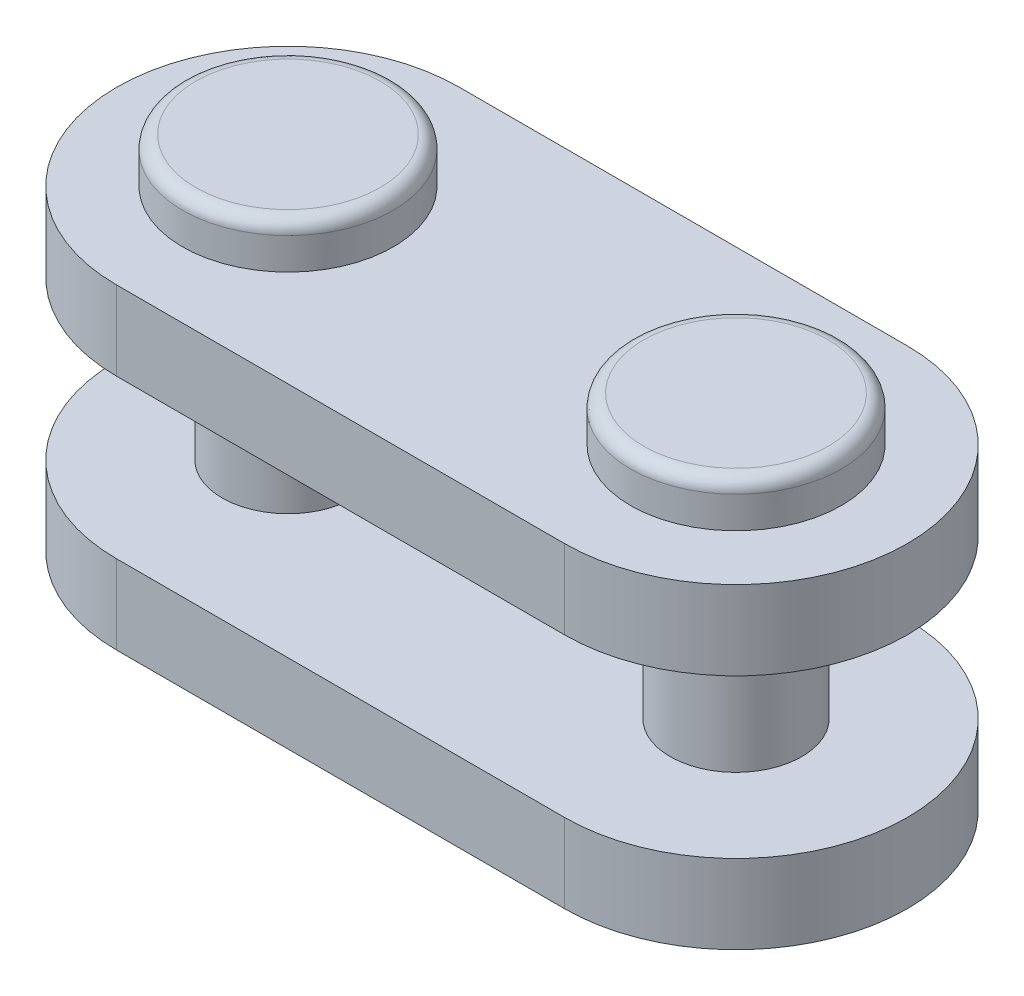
ISO-10303-21;
HEADER;
FILE_DESCRIPTION(('STEP AP214'),'2;1');
FILE_NAME('part.step','',(''),(''),'','','');
FILE_SCHEMA(('AUTOMOTIVE_DESIGN { 1 0 10303 214 1 1 1 1 }'));
ENDSEC;
DATA;
#1=APPLICATION_CONTEXT('core data for automotive mechanical design processes');
#2=APPLICATION_PROTOCOL_DEFINITION('international standard','automotive_design',2000,#1);
#3=PRODUCT_CONTEXT('',#1,'mechanical');
#4=PRODUCT('Part','Part','',(#3));
#5=PRODUCT_RELATED_PRODUCT_CATEGORY('part','',(#4));
#6=PRODUCT_DEFINITION_FORMATION('','',#4);
#7=PRODUCT_DEFINITION_CONTEXT('part definition',#1,'design');
#8=PRODUCT_DEFINITION('design','',#6,#7);
#9=PRODUCT_DEFINITION_SHAPE('','',#8);
#10=(LENGTH_UNIT() NAMED_UNIT(*) SI_UNIT(.MILLI.,.METRE.));
#11=(NAMED_UNIT(*) PLANE_ANGLE_UNIT() SI_UNIT($,.RADIAN.));
#12=(NAMED_UNIT(*) SI_UNIT($,.STERADIAN.) SOLID_ANGLE_UNIT());
#13=UNCERTAINTY_MEASURE_WITH_UNIT(LENGTH_MEASURE(1.E-05),#10,'distance_accuracy_value','');
#14=(GEOMETRIC_REPRESENTATION_CONTEXT(3) GLOBAL_UNCERTAINTY_ASSIGNED_CONTEXT((#13)) GLOBAL_UNIT_ASSIGNED_CONTEXT((#10,
#11,#12)) REPRESENTATION_CONTEXT('',''));
#15=CARTESIAN_POINT('',(0.,0.,0.));
#16=DIRECTION('',(0.,0.,1.));
#17=DIRECTION('',(1.,0.,0.));
#18=AXIS2_PLACEMENT_3D('',#15,#16,#17);
#19=CARTESIAN_POINT('',(1.28369537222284E-13,7.7,0.));
#20=DIRECTION('',(0.,-1.,0.));
#21=DIRECTION('',(0.664094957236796,0.,-0.747648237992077));
#22=AXIS2_PLACEMENT_3D('',#19,#20,#21);
#23=PLANE('',#22);
#24=CARTESIAN_POINT('',(1.28645684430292E-13,7.7,0.));
#25=DIRECTION('',(0.,-1.,0.));
#26=DIRECTION('',(0.664094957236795,0.,-0.747648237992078));
#27=AXIS2_PLACEMENT_3D('',#24,#25,#26);
#28=CIRCLE('',#27,3.49999999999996);
#29=CARTESIAN_POINT('',(2.32433235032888,7.7,-2.61676883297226));
#30=VERTEX_POINT('',#29);
#31=CARTESIAN_POINT('',(-2.32433235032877,7.7,2.61676883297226));
#32=VERTEX_POINT('',#31);
#33=EDGE_CURVE('E30',#30,#32,#28,.T.);
#34=ORIENTED_EDGE('',*,*,#33,.F.);
#35=CARTESIAN_POINT('',(1.28645684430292E-13,7.7,0.));
#36=DIRECTION('',(0.,-1.,0.));
#37=DIRECTION('',(-0.664094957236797,0.,0.747648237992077));
#38=AXIS2_PLACEMENT_3D('',#35,#36,#37);
#39=CIRCLE('',#38,3.49999999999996);
#40=EDGE_CURVE('E374',#32,#30,#39,.T.);
#41=ORIENTED_EDGE('',*,*,#40,.F.);
#42=EDGE_LOOP('',(#34,#41));
#43=FACE_BOUND('',#42,.T.);
#44=ADVANCED_FACE('F14',(#43),#23,.F.);
#45=CARTESIAN_POINT('',(1.28369537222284E-13,7.2,0.));
#46=DIRECTION('',(0.,-1.,0.));
#47=DIRECTION('',(0.664094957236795,0.,-0.747648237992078));
#48=AXIS2_PLACEMENT_3D('',#45,#46,#47);
#49=TOROIDAL_SURFACE('',#48,3.49999999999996,0.5);
#50=ORIENTED_EDGE('',*,*,#33,.T.);
#51=ORIENTED_EDGE('',*,*,#40,.T.);
#52=EDGE_LOOP('',(#50,#51));
#53=FACE_BOUND('',#52,.T.);
#54=CARTESIAN_POINT('',(1.28369537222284E-13,7.2,0.));
#55=DIRECTION('',(0.,1.,0.));
#56=DIRECTION('',(-0.664094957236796,0.,0.747648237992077));
#57=AXIS2_PLACEMENT_3D('',#54,#55,#56);
#58=CIRCLE('',#57,4.);
#59=CARTESIAN_POINT('',(-2.65637982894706,7.2,2.9905929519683));
#60=VERTEX_POINT('',#59);
#61=EDGE_CURVE('E232',#60,#60,#58,.F.);
#62=ORIENTED_EDGE('',*,*,#61,.F.);
#63=EDGE_LOOP('',(#62));
#64=FACE_BOUND('',#63,.T.);
#65=ADVANCED_FACE('F346',(#53,#64),#49,.T.);
#66=CARTESIAN_POINT('',(1.28369537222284E-13,6.,0.));
#67=DIRECTION('',(0.,1.,0.));
#68=DIRECTION('',(-0.664094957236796,0.,0.747648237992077));
#69=AXIS2_PLACEMENT_3D('',#66,#67,#68);
#70=CYLINDRICAL_SURFACE('',#69,4.);
#71=ORIENTED_EDGE('',*,*,#61,.T.);
#72=EDGE_LOOP('',(#71));
#73=FACE_BOUND('',#72,.T.);
#74=CARTESIAN_POINT('',(1.28369537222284E-13,6.0000000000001,0.));
#75=DIRECTION('',(0.,-1.,0.));
#76=DIRECTION('',(0.,0.,-1.));
#77=AXIS2_PLACEMENT_3D('',#74,#75,#76);
#78=CIRCLE('',#77,4.);
#79=CARTESIAN_POINT('',(1.28369537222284E-13,6.0000000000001,-3.99999999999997));
#80=VERTEX_POINT('',#79);
#81=EDGE_CURVE('E112',#80,#80,#78,.T.);
#82=ORIENTED_EDGE('',*,*,#81,.F.);
#83=EDGE_LOOP('',(#82));
#84=FACE_BOUND('',#83,.T.);
#85=ADVANCED_FACE('F16',(#73,#84),#70,.T.);
#86=CARTESIAN_POINT('',(17.0000000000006,6.0000000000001,3.46944695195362E-13));
#87=DIRECTION('',(0.,-1.,0.));
#88=DIRECTION('',(1.,0.,0.));
#89=AXIS2_PLACEMENT_3D('',#86,#87,#88);
#90=PLANE('',#89);
#91=ORIENTED_EDGE('',*,*,#81,.T.);
#92=EDGE_LOOP('',(#91));
#93=FACE_BOUND('',#92,.T.);
#94=DIRECTION('',(-1.,0.,0.));
#95=VECTOR('',#94,1.);
#96=CARTESIAN_POINT('',(17.0000000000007,6.00000000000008,-6.49999999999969));
#97=LINE('',#96,#95);
#98=CARTESIAN_POINT('',(17.0000000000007,6.00000000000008,-6.49999999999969));
#99=VERTEX_POINT('',#98);
#100=CARTESIAN_POINT('',(6.01949046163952E-13,6.00000000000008,-6.49999999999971));
#101=VERTEX_POINT('',#100);
#102=EDGE_CURVE('E105',#99,#101,#97,.T.);
#103=ORIENTED_EDGE('',*,*,#102,.T.);
#104=CARTESIAN_POINT('',(5.96744875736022E-13,6.0000000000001,3.19189119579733E-13));
#105=DIRECTION('',(0.,1.,0.));
#106=DIRECTION('',(-1.,0.,0.));
#107=AXIS2_PLACEMENT_3D('',#104,#105,#106);
#108=CIRCLE('',#107,6.5);
#109=CARTESIAN_POINT('',(5.96744875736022E-13,6.,6.50000000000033));
#110=VERTEX_POINT('',#109);
#111=EDGE_CURVE('E137',#110,#101,#108,.F.);
#112=ORIENTED_EDGE('',*,*,#111,.F.);
#113=DIRECTION('',(1.,0.,0.));
#114=VECTOR('',#113,1.);
#115=CARTESIAN_POINT('',(17.0000000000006,6.,6.5000000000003));
#116=LINE('',#115,#114);
#117=CARTESIAN_POINT('',(17.0000000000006,6.,6.5000000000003));
#118=VERTEX_POINT('',#117);
#119=EDGE_CURVE('E108',#110,#118,#116,.T.);
#120=ORIENTED_EDGE('',*,*,#119,.T.);
#121=CARTESIAN_POINT('',(17.0000000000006,6.0000000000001,3.46944695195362E-13));
#122=DIRECTION('',(0.,1.,0.));
#123=DIRECTION('',(-1.,0.,0.));
#124=AXIS2_PLACEMENT_3D('',#121,#122,#123);
#125=CIRCLE('',#124,6.5);
#126=EDGE_CURVE('E100',#99,#118,#125,.F.);
#127=ORIENTED_EDGE('',*,*,#126,.F.);
#128=EDGE_LOOP('',(#103,#112,#120,#127));
#129=FACE_BOUND('',#128,.T.);
#130=CARTESIAN_POINT('',(17.,6.0000000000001,0.));
#131=DIRECTION('',(0.,-1.,0.));
#132=DIRECTION('',(0.,0.,-1.));
#133=AXIS2_PLACEMENT_3D('',#130,#131,#132);
#134=CIRCLE('',#133,4.);
#135=CARTESIAN_POINT('',(17.,6.0000000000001,-4.00000000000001));
#136=VERTEX_POINT('',#135);
#137=EDGE_CURVE('E141',#136,#136,#134,.T.);
#138=ORIENTED_EDGE('',*,*,#137,.T.);
#139=EDGE_LOOP('',(#138));
#140=FACE_BOUND('',#139,.T.);
#141=ADVANCED_FACE('F102',(#93,#129,#140),#90,.F.);
#142=CARTESIAN_POINT('',(0.,-6.,0.));
#143=DIRECTION('',(0.,1.,0.));
#144=DIRECTION('',(-0.664094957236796,0.,0.747648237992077));
#145=AXIS2_PLACEMENT_3D('',#142,#143,#144);
#146=CYLINDRICAL_SURFACE('',#145,2.5);
#147=CARTESIAN_POINT('',(1.17961196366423E-13,3.0000000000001,0.));
#148=DIRECTION('',(0.,-1.,0.));
#149=DIRECTION('',(0.0365843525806,0.,-0.999330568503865));
#150=AXIS2_PLACEMENT_3D('',#147,#148,#149);
#151=CIRCLE('',#150,2.5);
#152=CARTESIAN_POINT('',(0.091460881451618,3.0000000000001,-2.49832642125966));
#153=VERTEX_POINT('',#152);
#154=EDGE_CURVE('E143',#153,#153,#151,.F.);
#155=ORIENTED_EDGE('',*,*,#154,.F.);
#156=EDGE_LOOP('',(#155));
#157=FACE_BOUND('',#156,.T.);
#158=CARTESIAN_POINT('',(0.,-3.,0.));
#159=DIRECTION('',(0.,-1.,0.));
#160=DIRECTION('',(0.0365843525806,0.,-0.999330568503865));
#161=AXIS2_PLACEMENT_3D('',#158,#159,#160);
#162=CIRCLE('',#161,2.5);
#163=CARTESIAN_POINT('',(0.0914608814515,-3.,-2.49832642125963));
#164=VERTEX_POINT('',#163);
#165=EDGE_CURVE('E229',#164,#164,#162,.F.);
#166=ORIENTED_EDGE('',*,*,#165,.T.);
#167=EDGE_LOOP('',(#166));
#168=FACE_BOUND('',#167,.T.);
#169=ADVANCED_FACE('F157',(#157,#168),#146,.T.);
#170=CARTESIAN_POINT('',(17.0000000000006,3.0000000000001,6.50000000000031));
#171=DIRECTION('',(0.,0.,-1.));
#172=DIRECTION('',(1.,0.,0.));
#173=AXIS2_PLACEMENT_3D('',#170,#171,#172);
#174=PLANE('',#173);
#175=DIRECTION('',(0.,1.,0.));
#176=VECTOR('',#175,1.);
#177=CARTESIAN_POINT('',(5.96744875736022E-13,3.00000000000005,6.50000000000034));
#178=LINE('',#177,#176);
#179=CARTESIAN_POINT('',(5.96744875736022E-13,3.00000000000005,6.50000000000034));
#180=VERTEX_POINT('',#179);
#181=EDGE_CURVE('E133',#180,#110,#178,.T.);
#182=ORIENTED_EDGE('',*,*,#181,.F.);
#183=DIRECTION('',(1.,0.,0.));
#184=VECTOR('',#183,1.);
#185=CARTESIAN_POINT('',(17.0000000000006,3.0000000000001,6.50000000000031));
#186=LINE('',#185,#184);
#187=CARTESIAN_POINT('',(17.0000000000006,3.0000000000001,6.50000000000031));
#188=VERTEX_POINT('',#187);
#189=EDGE_CURVE('E127',#188,#180,#186,.F.);
#190=ORIENTED_EDGE('',*,*,#189,.F.);
#191=DIRECTION('',(0.,-1.,0.));
#192=VECTOR('',#191,1.);
#193=CARTESIAN_POINT('',(17.0000000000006,3.0000000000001,6.50000000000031));
#194=LINE('',#193,#192);
#195=EDGE_CURVE('E111',#118,#188,#194,.T.);
#196=ORIENTED_EDGE('',*,*,#195,.F.);
#197=ORIENTED_EDGE('',*,*,#119,.F.);
#198=EDGE_LOOP('',(#182,#190,#196,#197));
#199=FACE_BOUND('',#198,.T.);
#200=ADVANCED_FACE('F218',(#199),#174,.F.);
#201=CARTESIAN_POINT('',(17.0000000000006,3.00000000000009,3.53883589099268E-13));
#202=DIRECTION('',(0.,1.,0.));
#203=DIRECTION('',(-1.,0.,0.));
#204=AXIS2_PLACEMENT_3D('',#201,#202,#203);
#205=CYLINDRICAL_SURFACE('',#204,6.5);
#206=CARTESIAN_POINT('',(17.0000000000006,3.00000000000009,3.53883589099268E-13));
#207=DIRECTION('',(0.,1.,0.));
#208=DIRECTION('',(-1.,0.,0.));
#209=AXIS2_PLACEMENT_3D('',#206,#207,#208);
#210=CIRCLE('',#209,6.5);
#211=CARTESIAN_POINT('',(17.0000000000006,3.00000000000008,-6.49999999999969));
#212=VERTEX_POINT('',#211);
#213=EDGE_CURVE('E118',#212,#188,#210,.F.);
#214=ORIENTED_EDGE('',*,*,#213,.F.);
#215=DIRECTION('',(0.,-1.,0.));
#216=VECTOR('',#215,1.);
#217=CARTESIAN_POINT('',(17.0000000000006,3.00000000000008,-6.49999999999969));
#218=LINE('',#217,#216);
#219=EDGE_CURVE('E115',#212,#99,#218,.F.);
#220=ORIENTED_EDGE('',*,*,#219,.T.);
#221=ORIENTED_EDGE('',*,*,#126,.T.);
#222=ORIENTED_EDGE('',*,*,#195,.T.);
#223=EDGE_LOOP('',(#214,#220,#221,#222));
#224=FACE_BOUND('',#223,.T.);
#225=ADVANCED_FACE('F116',(#224),#205,.T.);
#226=CARTESIAN_POINT('',(17.0000000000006,3.00000000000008,-6.49999999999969));
#227=DIRECTION('',(0.,0.,1.));
#228=DIRECTION('',(-1.,0.,0.));
#229=AXIS2_PLACEMENT_3D('',#226,#227,#228);
#230=PLANE('',#229);
#231=ORIENTED_EDGE('',*,*,#219,.F.);
#232=DIRECTION('',(1.,0.,0.));
#233=VECTOR('',#232,1.);
#234=CARTESIAN_POINT('',(17.0000000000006,3.00000000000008,-6.49999999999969));
#235=LINE('',#234,#233);
#236=CARTESIAN_POINT('',(6.08887940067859E-13,3.00000000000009,-6.49999999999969));
#237=VERTEX_POINT('',#236);
#238=EDGE_CURVE('E135',#237,#212,#235,.T.);
#239=ORIENTED_EDGE('',*,*,#238,.F.);
#240=DIRECTION('',(0.,-1.,0.));
#241=VECTOR('',#240,1.);
#242=CARTESIAN_POINT('',(6.08887940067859E-13,3.00000000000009,-6.49999999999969));
#243=LINE('',#242,#241);
#244=EDGE_CURVE('E122',#101,#237,#243,.T.);
#245=ORIENTED_EDGE('',*,*,#244,.F.);
#246=ORIENTED_EDGE('',*,*,#102,.F.);
#247=EDGE_LOOP('',(#231,#239,#245,#246));
#248=FACE_BOUND('',#247,.T.);
#249=ADVANCED_FACE('F124',(#248),#230,.F.);
#250=CARTESIAN_POINT('',(6.03683769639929E-13,3.0000000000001,3.67761376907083E-13));
#251=DIRECTION('',(0.,1.,0.));
#252=DIRECTION('',(-1.,0.,0.));
#253=AXIS2_PLACEMENT_3D('',#250,#251,#252);
#254=CYLINDRICAL_SURFACE('',#253,6.5);
#255=ORIENTED_EDGE('',*,*,#111,.T.);
#256=ORIENTED_EDGE('',*,*,#244,.T.);
#257=CARTESIAN_POINT('',(6.03683769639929E-13,3.0000000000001,3.67761376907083E-13));
#258=DIRECTION('',(0.,1.,0.));
#259=DIRECTION('',(-1.,0.,0.));
#260=AXIS2_PLACEMENT_3D('',#257,#258,#259);
#261=CIRCLE('',#260,6.5);
#262=EDGE_CURVE('E134',#180,#237,#261,.F.);
#263=ORIENTED_EDGE('',*,*,#262,.F.);
#264=ORIENTED_EDGE('',*,*,#181,.T.);
#265=EDGE_LOOP('',(#255,#256,#263,#264));
#266=FACE_BOUND('',#265,.T.);
#267=ADVANCED_FACE('F215',(#266),#254,.T.);
#268=CARTESIAN_POINT('',(17.0000000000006,-6.,2.91433543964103E-13));
#269=DIRECTION('',(0.,1.,0.));
#270=DIRECTION('',(-1.,0.,0.));
#271=AXIS2_PLACEMENT_3D('',#268,#269,#270);
#272=CYLINDRICAL_SURFACE('',#271,6.5);
#273=CARTESIAN_POINT('',(17.0000000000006,-6.,2.91433543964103E-13));
#274=DIRECTION('',(0.,1.,0.));
#275=DIRECTION('',(-1.,0.,0.));
#276=AXIS2_PLACEMENT_3D('',#273,#274,#275);
#277=CIRCLE('',#276,6.5);
#278=CARTESIAN_POINT('',(17.0000000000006,-6.,-6.49999999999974));
#279=VERTEX_POINT('',#278);
#280=CARTESIAN_POINT('',(17.0000000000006,-6.,6.50000000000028));
#281=VERTEX_POINT('',#280);
#282=EDGE_CURVE('E189',#279,#281,#277,.F.);
#283=ORIENTED_EDGE('',*,*,#282,.F.);
#284=DIRECTION('',(0.,-1.,0.));
#285=VECTOR('',#284,1.);
#286=CARTESIAN_POINT('',(17.0000000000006,-6.,-6.49999999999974));
#287=LINE('',#286,#285);
#288=CARTESIAN_POINT('',(17.0000000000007,-3.,-6.49999999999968));
#289=VERTEX_POINT('',#288);
#290=EDGE_CURVE('E178',#279,#289,#287,.F.);
#291=ORIENTED_EDGE('',*,*,#290,.T.);
#292=CARTESIAN_POINT('',(17.0000000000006,-3.,3.19189119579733E-13));
#293=DIRECTION('',(0.,1.,0.));
#294=DIRECTION('',(-1.,0.,0.));
#295=AXIS2_PLACEMENT_3D('',#292,#293,#294);
#296=CIRCLE('',#295,6.5);
#297=CARTESIAN_POINT('',(17.0000000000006,-3.00000000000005,6.50000000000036));
#298=VERTEX_POINT('',#297);
#299=EDGE_CURVE('E198',#289,#298,#296,.F.);
#300=ORIENTED_EDGE('',*,*,#299,.T.);
#301=DIRECTION('',(0.,-1.,0.));
#302=VECTOR('',#301,1.);
#303=CARTESIAN_POINT('',(17.0000000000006,-6.,6.50000000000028));
#304=LINE('',#303,#302);
#305=EDGE_CURVE('E196',#298,#281,#304,.T.);
#306=ORIENTED_EDGE('',*,*,#305,.T.);
#307=EDGE_LOOP('',(#283,#291,#300,#306));
#308=FACE_BOUND('',#307,.T.);
#309=ADVANCED_FACE('F309',(#308),#272,.T.);
#310=CARTESIAN_POINT('',(17.0000000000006,-6.,6.50000000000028));
#311=DIRECTION('',(0.,0.,-1.));
#312=DIRECTION('',(1.,0.,0.));
#313=AXIS2_PLACEMENT_3D('',#310,#311,#312);
#314=PLANE('',#313);
#315=DIRECTION('',(0.,1.,0.));
#316=VECTOR('',#315,1.);
#317=CARTESIAN_POINT('',(5.96744875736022E-13,-6.,6.50000000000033));
#318=LINE('',#317,#316);
#319=CARTESIAN_POINT('',(5.96744875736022E-13,-6.,6.50000000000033));
#320=VERTEX_POINT('',#319);
#321=CARTESIAN_POINT('',(5.82867087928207E-13,-3.,6.50000000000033));
#322=VERTEX_POINT('',#321);
#323=EDGE_CURVE('E193',#320,#322,#318,.T.);
#324=ORIENTED_EDGE('',*,*,#323,.F.);
#325=DIRECTION('',(1.,0.,0.));
#326=VECTOR('',#325,1.);
#327=CARTESIAN_POINT('',(17.0000000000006,-6.,6.50000000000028));
#328=LINE('',#327,#326);
#329=EDGE_CURVE('E167',#281,#320,#328,.F.);
#330=ORIENTED_EDGE('',*,*,#329,.F.);
#331=ORIENTED_EDGE('',*,*,#305,.F.);
#332=DIRECTION('',(1.,0.,0.));
#333=VECTOR('',#332,1.);
#334=CARTESIAN_POINT('',(17.0000000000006,-3.00000000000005,6.50000000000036));
#335=LINE('',#334,#333);
#336=EDGE_CURVE('E195',#322,#298,#335,.T.);
#337=ORIENTED_EDGE('',*,*,#336,.F.);
#338=EDGE_LOOP('',(#324,#330,#331,#337));
#339=FACE_BOUND('',#338,.T.);
#340=ADVANCED_FACE('F306',(#339),#314,.F.);
#341=CARTESIAN_POINT('',(6.07153216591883E-13,-6.,2.98372437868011E-13));
#342=DIRECTION('',(0.,1.,0.));
#343=DIRECTION('',(-1.,0.,0.));
#344=AXIS2_PLACEMENT_3D('',#341,#342,#343);
#345=CYLINDRICAL_SURFACE('',#344,6.5);
#346=CARTESIAN_POINT('',(5.89805981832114E-13,-3.,3.19189119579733E-13));
#347=DIRECTION('',(0.,1.,0.));
#348=DIRECTION('',(-1.,0.,0.));
#349=AXIS2_PLACEMENT_3D('',#346,#347,#348);
#350=CIRCLE('',#349,6.5);
#351=CARTESIAN_POINT('',(5.8113236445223E-13,-3.,-6.49999999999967));
#352=VERTEX_POINT('',#351);
#353=EDGE_CURVE('E174',#322,#352,#350,.F.);
#354=ORIENTED_EDGE('',*,*,#353,.T.);
#355=DIRECTION('',(0.,-1.,0.));
#356=VECTOR('',#355,1.);
#357=CARTESIAN_POINT('',(6.05418493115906E-13,-6.,-6.49999999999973));
#358=LINE('',#357,#356);
#359=CARTESIAN_POINT('',(6.05418493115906E-13,-6.,-6.49999999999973));
#360=VERTEX_POINT('',#359);
#361=EDGE_CURVE('E172',#352,#360,#358,.T.);
#362=ORIENTED_EDGE('',*,*,#361,.T.);
#363=CARTESIAN_POINT('',(6.07153216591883E-13,-6.,2.98372437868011E-13));
#364=DIRECTION('',(0.,1.,0.));
#365=DIRECTION('',(-1.,0.,0.));
#366=AXIS2_PLACEMENT_3D('',#363,#364,#365);
#367=CIRCLE('',#366,6.5);
#368=EDGE_CURVE('E161',#320,#360,#367,.F.);
#369=ORIENTED_EDGE('',*,*,#368,.F.);
#370=ORIENTED_EDGE('',*,*,#323,.T.);
#371=EDGE_LOOP('',(#354,#362,#369,#370));
#372=FACE_BOUND('',#371,.T.);
#373=ADVANCED_FACE('F173',(#372),#345,.T.);
#374=CARTESIAN_POINT('',(17.0000000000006,-6.,-6.49999999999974));
#375=DIRECTION('',(0.,0.,1.));
#376=DIRECTION('',(-1.,0.,0.));
#377=AXIS2_PLACEMENT_3D('',#374,#375,#376);
#378=PLANE('',#377);
#379=ORIENTED_EDGE('',*,*,#290,.F.);
#380=DIRECTION('',(1.,0.,0.));
#381=VECTOR('',#380,1.);
#382=CARTESIAN_POINT('',(17.0000000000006,-6.,-6.49999999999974));
#383=LINE('',#382,#381);
#384=EDGE_CURVE('E165',#360,#279,#383,.T.);
#385=ORIENTED_EDGE('',*,*,#384,.F.);
#386=ORIENTED_EDGE('',*,*,#361,.F.);
#387=DIRECTION('',(-1.,0.,0.));
#388=VECTOR('',#387,1.);
#389=CARTESIAN_POINT('',(17.0000000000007,-3.,-6.49999999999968));
#390=LINE('',#389,#388);
#391=EDGE_CURVE('E192',#289,#352,#390,.T.);
#392=ORIENTED_EDGE('',*,*,#391,.F.);
#393=EDGE_LOOP('',(#379,#385,#386,#392));
#394=FACE_BOUND('',#393,.T.);
#395=ADVANCED_FACE('F156',(#394),#378,.F.);
#396=CARTESIAN_POINT('',(17.,-6.,0.));
#397=DIRECTION('',(0.,1.,0.));
#398=DIRECTION('',(-0.837584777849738,0.,-0.546307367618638));
#399=AXIS2_PLACEMENT_3D('',#396,#397,#398);
#400=CYLINDRICAL_SURFACE('',#399,2.5);
#401=CARTESIAN_POINT('',(17.0000000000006,-3.,3.19189119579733E-13));
#402=DIRECTION('',(0.,1.,0.));
#403=DIRECTION('',(-1.,0.,0.));
#404=AXIS2_PLACEMENT_3D('',#401,#402,#403);
#405=CIRCLE('',#404,2.5);
#406=CARTESIAN_POINT('',(14.5000000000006,-3.,3.19744231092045E-13));
#407=VERTEX_POINT('',#406);
#408=EDGE_CURVE('E203',#407,#407,#405,.F.);
#409=ORIENTED_EDGE('',*,*,#408,.F.);
#410=EDGE_LOOP('',(#409));
#411=FACE_BOUND('',#410,.T.);
#412=CARTESIAN_POINT('',(17.,3.00000000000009,0.));
#413=DIRECTION('',(0.,-1.,0.));
#414=DIRECTION('',(0.0365843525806,0.,-0.999330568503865));
#415=AXIS2_PLACEMENT_3D('',#412,#413,#414);
#416=CIRCLE('',#415,2.5);
#417=CARTESIAN_POINT('',(17.0914608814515,3.00000000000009,-2.49832642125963));
#418=VERTEX_POINT('',#417);
#419=EDGE_CURVE('E187',#418,#418,#416,.F.);
#420=ORIENTED_EDGE('',*,*,#419,.F.);
#421=EDGE_LOOP('',(#420));
#422=FACE_BOUND('',#421,.T.);
#423=ADVANCED_FACE('F225',(#411,#422),#400,.T.);
#424=CARTESIAN_POINT('',(17.0000000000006,-3.,3.19189119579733E-13));
#425=DIRECTION('',(0.,-1.,0.));
#426=DIRECTION('',(1.,0.,0.));
#427=AXIS2_PLACEMENT_3D('',#424,#425,#426);
#428=PLANE('',#427);
#429=ORIENTED_EDGE('',*,*,#408,.T.);
#430=EDGE_LOOP('',(#429));
#431=FACE_BOUND('',#430,.T.);
#432=ORIENTED_EDGE('',*,*,#391,.T.);
#433=ORIENTED_EDGE('',*,*,#353,.F.);
#434=ORIENTED_EDGE('',*,*,#336,.T.);
#435=ORIENTED_EDGE('',*,*,#299,.F.);
#436=EDGE_LOOP('',(#432,#433,#434,#435));
#437=FACE_BOUND('',#436,.T.);
#438=ORIENTED_EDGE('',*,*,#165,.F.);
#439=EDGE_LOOP('',(#438));
#440=FACE_BOUND('',#439,.T.);
#441=ADVANCED_FACE('F222',(#431,#437,#440),#428,.F.);
#442=CARTESIAN_POINT('',(17.0000000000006,3.00000000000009,3.53883589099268E-13));
#443=DIRECTION('',(0.,-1.,0.));
#444=DIRECTION('',(1.,0.,0.));
#445=AXIS2_PLACEMENT_3D('',#442,#443,#444);
#446=PLANE('',#445);
#447=ORIENTED_EDGE('',*,*,#419,.T.);
#448=EDGE_LOOP('',(#447));
#449=FACE_BOUND('',#448,.T.);
#450=ORIENTED_EDGE('',*,*,#262,.T.);
#451=ORIENTED_EDGE('',*,*,#238,.T.);
#452=ORIENTED_EDGE('',*,*,#213,.T.);
#453=ORIENTED_EDGE('',*,*,#189,.T.);
#454=EDGE_LOOP('',(#450,#451,#452,#453));
#455=FACE_BOUND('',#454,.T.);
#456=ORIENTED_EDGE('',*,*,#154,.T.);
#457=EDGE_LOOP('',(#456));
#458=FACE_BOUND('',#457,.T.);
#459=ADVANCED_FACE('F153',(#449,#455,#458),#446,.T.);
#460=CARTESIAN_POINT('',(17.0000000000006,-6.,2.91433543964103E-13));
#461=DIRECTION('',(0.,-1.,0.));
#462=DIRECTION('',(1.,0.,0.));
#463=AXIS2_PLACEMENT_3D('',#460,#461,#462);
#464=PLANE('',#463);
#465=CARTESIAN_POINT('',(17.,-6.,0.));
#466=DIRECTION('',(0.,-1.,0.));
#467=DIRECTION('',(0.,0.,-1.));
#468=AXIS2_PLACEMENT_3D('',#465,#466,#467);
#469=CIRCLE('',#468,4.);
#470=CARTESIAN_POINT('',(17.,-6.,-3.99999999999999));
#471=VERTEX_POINT('',#470);
#472=EDGE_CURVE('E9',#471,#471,#469,.T.);
#473=ORIENTED_EDGE('',*,*,#472,.F.);
#474=EDGE_LOOP('',(#473));
#475=FACE_BOUND('',#474,.T.);
#476=CARTESIAN_POINT('',(0.,-6.,0.));
#477=DIRECTION('',(0.,-1.,0.));
#478=DIRECTION('',(0.,0.,-1.));
#479=AXIS2_PLACEMENT_3D('',#476,#477,#478);
#480=CIRCLE('',#479,4.);
#481=CARTESIAN_POINT('',(0.,-6.,-3.99999999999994));
#482=VERTEX_POINT('',#481);
#483=EDGE_CURVE('E23',#482,#482,#480,.T.);
#484=ORIENTED_EDGE('',*,*,#483,.F.);
#485=EDGE_LOOP('',(#484));
#486=FACE_BOUND('',#485,.T.);
#487=ORIENTED_EDGE('',*,*,#368,.T.);
#488=ORIENTED_EDGE('',*,*,#384,.T.);
#489=ORIENTED_EDGE('',*,*,#282,.T.);
#490=ORIENTED_EDGE('',*,*,#329,.T.);
#491=EDGE_LOOP('',(#487,#488,#489,#490));
#492=FACE_BOUND('',#491,.T.);
#493=ADVANCED_FACE('F149',(#475,#486,#492),#464,.T.);
#494=CARTESIAN_POINT('',(17.,7.7,0.));
#495=DIRECTION('',(0.,-1.,0.));
#496=DIRECTION('',(0.837584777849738,0.,0.546307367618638));
#497=AXIS2_PLACEMENT_3D('',#494,#495,#496);
#498=PLANE('',#497);
#499=CARTESIAN_POINT('',(17.,7.70000000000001,0.));
#500=DIRECTION('',(0.,-1.,0.));
#501=DIRECTION('',(0.837584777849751,0.,0.546307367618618));
#502=AXIS2_PLACEMENT_3D('',#499,#500,#501);
#503=CIRCLE('',#502,3.50000000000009);
#504=CARTESIAN_POINT('',(19.9315467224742,7.7,1.91207578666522));
#505=VERTEX_POINT('',#504);
#506=CARTESIAN_POINT('',(14.068453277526,7.7,-1.91207578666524));
#507=VERTEX_POINT('',#506);
#508=EDGE_CURVE('E284',#505,#507,#503,.T.);
#509=ORIENTED_EDGE('',*,*,#508,.F.);
#510=CARTESIAN_POINT('',(17.,7.70000000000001,0.));
#511=DIRECTION('',(0.,-1.,0.));
#512=DIRECTION('',(-0.83758477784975,0.,-0.54630736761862));
#513=AXIS2_PLACEMENT_3D('',#510,#511,#512);
#514=CIRCLE('',#513,3.50000000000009);
#515=EDGE_CURVE('E613',#507,#505,#514,.T.);
#516=ORIENTED_EDGE('',*,*,#515,.F.);
#517=EDGE_LOOP('',(#509,#516));
#518=FACE_BOUND('',#517,.T.);
#519=ADVANCED_FACE('F152',(#518),#498,.F.);
#520=CARTESIAN_POINT('',(17.,7.2,0.));
#521=DIRECTION('',(0.,-1.,0.));
#522=DIRECTION('',(0.837584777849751,0.,0.546307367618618));
#523=AXIS2_PLACEMENT_3D('',#520,#521,#522);
#524=TOROIDAL_SURFACE('',#523,3.50000000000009,0.5);
#525=ORIENTED_EDGE('',*,*,#508,.T.);
#526=ORIENTED_EDGE('',*,*,#515,.T.);
#527=EDGE_LOOP('',(#525,#526));
#528=FACE_BOUND('',#527,.T.);
#529=CARTESIAN_POINT('',(17.,7.2,0.));
#530=DIRECTION('',(0.,1.,0.));
#531=DIRECTION('',(-0.837584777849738,0.,-0.546307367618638));
#532=AXIS2_PLACEMENT_3D('',#529,#530,#531);
#533=CIRCLE('',#532,4.);
#534=CARTESIAN_POINT('',(13.649660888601,7.20000000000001,-2.18522947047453));
#535=VERTEX_POINT('',#534);
#536=EDGE_CURVE('E238',#535,#535,#533,.F.);
#537=ORIENTED_EDGE('',*,*,#536,.F.);
#538=EDGE_LOOP('',(#537));
#539=FACE_BOUND('',#538,.T.);
#540=ADVANCED_FACE('F241',(#528,#539),#524,.T.);
#541=CARTESIAN_POINT('',(17.,6.,0.));
#542=DIRECTION('',(0.,1.,0.));
#543=DIRECTION('',(-0.837584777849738,0.,-0.546307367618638));
#544=AXIS2_PLACEMENT_3D('',#541,#542,#543);
#545=CYLINDRICAL_SURFACE('',#544,4.);
#546=ORIENTED_EDGE('',*,*,#536,.T.);
#547=EDGE_LOOP('',(#546));
#548=FACE_BOUND('',#547,.T.);
#549=ORIENTED_EDGE('',*,*,#137,.F.);
#550=EDGE_LOOP('',(#549));
#551=FACE_BOUND('',#550,.T.);
#552=ADVANCED_FACE('F246',(#548,#551),#545,.T.);
#553=CARTESIAN_POINT('',(0.,-7.7,0.));
#554=DIRECTION('',(0.,1.,0.));
#555=DIRECTION('',(-0.664094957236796,0.,0.747648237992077));
#556=AXIS2_PLACEMENT_3D('',#553,#554,#555);
#557=PLANE('',#556);
#558=CARTESIAN_POINT('',(0.,-7.7,0.));
#559=DIRECTION('',(0.,1.,0.));
#560=DIRECTION('',(-0.664094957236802,0.,0.747648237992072));
#561=AXIS2_PLACEMENT_3D('',#558,#559,#560);
#562=CIRCLE('',#561,3.49999999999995);
#563=CARTESIAN_POINT('',(-2.32433235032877,-7.7,2.61676883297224));
#564=VERTEX_POINT('',#563);
#565=CARTESIAN_POINT('',(2.32433235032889,-7.7,-2.61676883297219));
#566=VERTEX_POINT('',#565);
#567=EDGE_CURVE('E206',#564,#566,#562,.T.);
#568=ORIENTED_EDGE('',*,*,#567,.F.);
#569=CARTESIAN_POINT('',(0.,-7.7,0.));
#570=DIRECTION('',(0.,1.,0.));
#571=DIRECTION('',(0.664094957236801,0.,-0.747648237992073));
#572=AXIS2_PLACEMENT_3D('',#569,#570,#571);
#573=CIRCLE('',#572,3.49999999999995);
#574=EDGE_CURVE('E396',#566,#564,#573,.T.);
#575=ORIENTED_EDGE('',*,*,#574,.F.);
#576=EDGE_LOOP('',(#568,#575));
#577=FACE_BOUND('',#576,.T.);
#578=ADVANCED_FACE('F330',(#577),#557,.F.);
#579=CARTESIAN_POINT('',(0.,-7.2,0.));
#580=DIRECTION('',(0.,1.,0.));
#581=DIRECTION('',(-0.664094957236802,0.,0.747648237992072));
#582=AXIS2_PLACEMENT_3D('',#579,#580,#581);
#583=TOROIDAL_SURFACE('',#582,3.49999999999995,0.5);
#584=ORIENTED_EDGE('',*,*,#567,.T.);
#585=ORIENTED_EDGE('',*,*,#574,.T.);
#586=EDGE_LOOP('',(#584,#585));
#587=FACE_BOUND('',#586,.T.);
#588=CARTESIAN_POINT('',(0.,-7.2,0.));
#589=DIRECTION('',(0.,-1.,0.));
#590=DIRECTION('',(0.664094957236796,0.,-0.747648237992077));
#591=AXIS2_PLACEMENT_3D('',#588,#589,#590);
#592=CIRCLE('',#591,4.);
#593=CARTESIAN_POINT('',(2.65637982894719,-7.2,-2.99059295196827));
#594=VERTEX_POINT('',#593);
#595=EDGE_CURVE('E391',#594,#594,#592,.F.);
#596=ORIENTED_EDGE('',*,*,#595,.F.);
#597=EDGE_LOOP('',(#596));
#598=FACE_BOUND('',#597,.T.);
#599=ADVANCED_FACE('F333',(#587,#598),#583,.T.);
#600=CARTESIAN_POINT('',(0.,-6.,0.));
#601=DIRECTION('',(0.,-1.,0.));
#602=DIRECTION('',(0.664094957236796,0.,-0.747648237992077));
#603=AXIS2_PLACEMENT_3D('',#600,#601,#602);
#604=CYLINDRICAL_SURFACE('',#603,4.);
#605=ORIENTED_EDGE('',*,*,#595,.T.);
#606=EDGE_LOOP('',(#605));
#607=FACE_BOUND('',#606,.T.);
#608=ORIENTED_EDGE('',*,*,#483,.T.);
#609=EDGE_LOOP('',(#608));
#610=FACE_BOUND('',#609,.T.);
#611=ADVANCED_FACE('F147',(#607,#610),#604,.T.);
#612=CARTESIAN_POINT('',(17.,-7.7,0.));
#613=DIRECTION('',(0.,1.,0.));
#614=DIRECTION('',(-0.837584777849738,0.,-0.546307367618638));
#615=AXIS2_PLACEMENT_3D('',#612,#613,#614);
#616=PLANE('',#615);
#617=CARTESIAN_POINT('',(17.,-7.70000000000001,0.));
#618=DIRECTION('',(0.,1.,0.));
#619=DIRECTION('',(-0.837584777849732,0.,-0.546307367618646));
#620=AXIS2_PLACEMENT_3D('',#617,#618,#619);
#621=CIRCLE('',#620,3.49999999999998);
#622=CARTESIAN_POINT('',(14.068453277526,-7.7,-1.91207578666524));
#623=VERTEX_POINT('',#622);
#624=CARTESIAN_POINT('',(19.9315467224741,-7.7,1.91207578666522));
#625=VERTEX_POINT('',#624);
#626=EDGE_CURVE('E182',#623,#625,#621,.T.);
#627=ORIENTED_EDGE('',*,*,#626,.F.);
#628=CARTESIAN_POINT('',(17.,-7.70000000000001,0.));
#629=DIRECTION('',(0.,1.,0.));
#630=DIRECTION('',(0.837584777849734,0.,0.546307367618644));
#631=AXIS2_PLACEMENT_3D('',#628,#629,#630);
#632=CIRCLE('',#631,3.49999999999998);
#633=EDGE_CURVE('E184',#625,#623,#632,.T.);
#634=ORIENTED_EDGE('',*,*,#633,.F.);
#635=EDGE_LOOP('',(#627,#634));
#636=FACE_BOUND('',#635,.T.);
#637=ADVANCED_FACE('F283',(#636),#616,.F.);
#638=CARTESIAN_POINT('',(17.,-7.2,0.));
#639=DIRECTION('',(0.,1.,0.));
#640=DIRECTION('',(-0.837584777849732,0.,-0.546307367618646));
#641=AXIS2_PLACEMENT_3D('',#638,#639,#640);
#642=TOROIDAL_SURFACE('',#641,3.49999999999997,0.5);
#643=ORIENTED_EDGE('',*,*,#626,.T.);
#644=ORIENTED_EDGE('',*,*,#633,.T.);
#645=EDGE_LOOP('',(#643,#644));
#646=FACE_BOUND('',#645,.T.);
#647=CARTESIAN_POINT('',(17.,-7.2,0.));
#648=DIRECTION('',(0.,-1.,0.));
#649=DIRECTION('',(0.837584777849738,0.,0.546307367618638));
#650=AXIS2_PLACEMENT_3D('',#647,#648,#649);
#651=CIRCLE('',#650,4.);
#652=CARTESIAN_POINT('',(20.350339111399,-7.20000000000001,2.18522947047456));
#653=VERTEX_POINT('',#652);
#654=EDGE_CURVE('E611',#653,#653,#651,.F.);
#655=ORIENTED_EDGE('',*,*,#654,.F.);
#656=EDGE_LOOP('',(#655));
#657=FACE_BOUND('',#656,.T.);
#658=ADVANCED_FACE('F249',(#646,#657),#642,.T.);
#659=CARTESIAN_POINT('',(17.,-6.,0.));
#660=DIRECTION('',(0.,-1.,0.));
#661=DIRECTION('',(0.837584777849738,0.,0.546307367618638));
#662=AXIS2_PLACEMENT_3D('',#659,#660,#661);
#663=CYLINDRICAL_SURFACE('',#662,4.);
#664=ORIENTED_EDGE('',*,*,#654,.T.);
#665=EDGE_LOOP('',(#664));
#666=FACE_BOUND('',#665,.T.);
#667=ORIENTED_EDGE('',*,*,#472,.T.);
#668=EDGE_LOOP('',(#667));
#669=FACE_BOUND('',#668,.T.);
#670=ADVANCED_FACE('F335',(#666,#669),#663,.T.);
#671=CLOSED_SHELL('',(#44,#65,#85,#141,#169,#200,#225,#249,#267,#309,#340,#373,#395,#423,#441,
#459,#493,#519,#540,#552,#578,#599,#611,#637,#658,#670));
#672=MANIFOLD_SOLID_BREP('B1',#671);
#673=ADVANCED_BREP_SHAPE_REPRESENTATION('',(#18,#672),#14);
#674=SHAPE_DEFINITION_REPRESENTATION(#9,#673);
ENDSEC;
END-ISO-10303-21;
